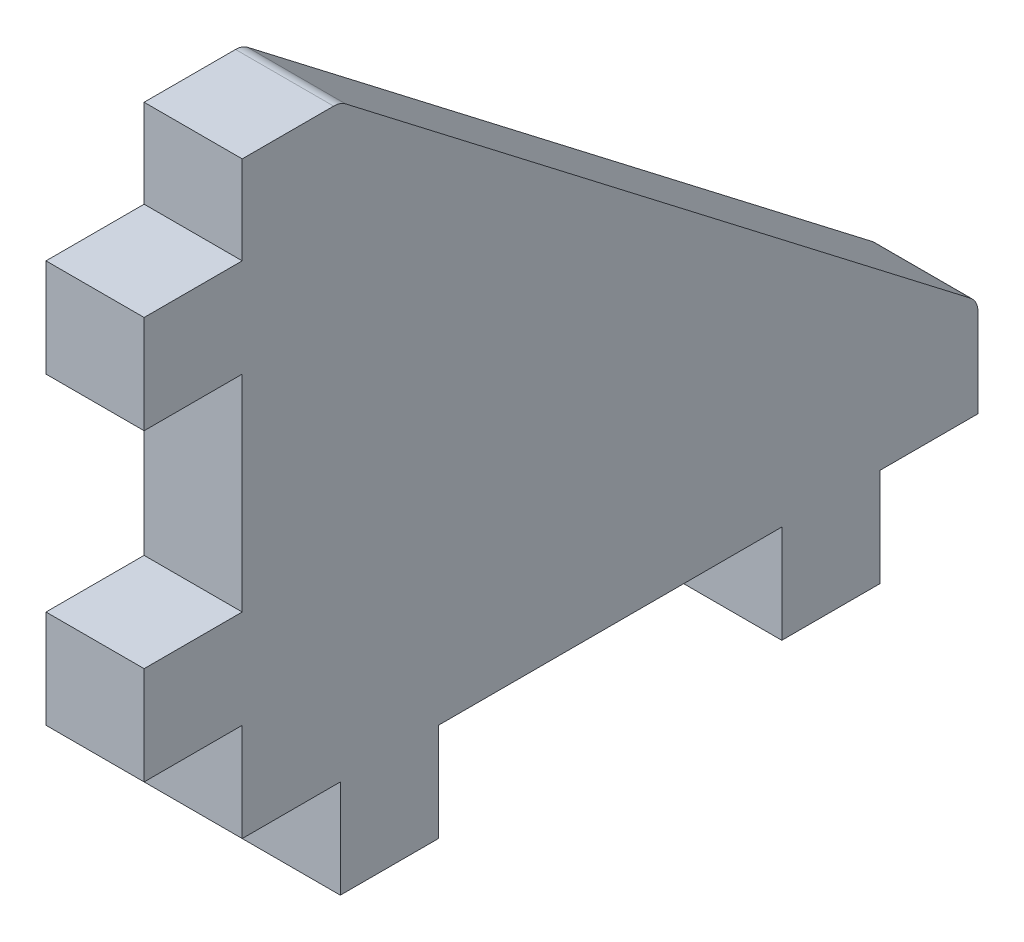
ISO-10303-21;
HEADER;
FILE_DESCRIPTION(('STEP AP214'),'2;1');
FILE_NAME('part.step','',(''),(''),'','','');
FILE_SCHEMA(('AUTOMOTIVE_DESIGN { 1 0 10303 214 1 1 1 1 }'));
ENDSEC;
DATA;
#1=APPLICATION_CONTEXT('core data for automotive mechanical design processes');
#2=APPLICATION_PROTOCOL_DEFINITION('international standard','automotive_design',2000,#1);
#3=PRODUCT_CONTEXT('',#1,'mechanical');
#4=PRODUCT('Part','Part','',(#3));
#5=PRODUCT_RELATED_PRODUCT_CATEGORY('part','',(#4));
#6=PRODUCT_DEFINITION_FORMATION('','',#4);
#7=PRODUCT_DEFINITION_CONTEXT('part definition',#1,'design');
#8=PRODUCT_DEFINITION('design','',#6,#7);
#9=PRODUCT_DEFINITION_SHAPE('','',#8);
#10=(LENGTH_UNIT() NAMED_UNIT(*) SI_UNIT(.MILLI.,.METRE.));
#11=(NAMED_UNIT(*) PLANE_ANGLE_UNIT() SI_UNIT($,.RADIAN.));
#12=(NAMED_UNIT(*) SI_UNIT($,.STERADIAN.) SOLID_ANGLE_UNIT());
#13=UNCERTAINTY_MEASURE_WITH_UNIT(LENGTH_MEASURE(1.E-05),#10,'distance_accuracy_value','');
#14=(GEOMETRIC_REPRESENTATION_CONTEXT(3) GLOBAL_UNCERTAINTY_ASSIGNED_CONTEXT((#13)) GLOBAL_UNIT_ASSIGNED_CONTEXT((#10,
#11,#12)) REPRESENTATION_CONTEXT('',''));
#15=CARTESIAN_POINT('',(0.,0.,0.));
#16=DIRECTION('',(0.,0.,1.));
#17=DIRECTION('',(1.,0.,0.));
#18=AXIS2_PLACEMENT_3D('',#15,#16,#17);
#19=CARTESIAN_POINT('',(20.,0.,0.));
#20=DIRECTION('',(0.,0.,-1.));
#21=DIRECTION('',(-1.,0.,0.));
#22=AXIS2_PLACEMENT_3D('',#19,#20,#21);
#23=PLANE('',#22);
#24=DIRECTION('',(0.,-1.,0.));
#25=VECTOR('',#24,1.);
#26=CARTESIAN_POINT('',(0.,0.,0.));
#27=LINE('',#26,#25);
#28=CARTESIAN_POINT('',(0.,20.,0.));
#29=VERTEX_POINT('',#28);
#30=CARTESIAN_POINT('',(0.,0.,0.));
#31=VERTEX_POINT('',#30);
#32=EDGE_CURVE('E214',#29,#31,#27,.T.);
#33=ORIENTED_EDGE('',*,*,#32,.T.);
#34=DIRECTION('',(-1.,0.,0.));
#35=VECTOR('',#34,1.);
#36=CARTESIAN_POINT('',(20.,0.,0.));
#37=LINE('',#36,#35);
#38=CARTESIAN_POINT('',(20.,0.,0.));
#39=VERTEX_POINT('',#38);
#40=EDGE_CURVE('E196',#39,#31,#37,.T.);
#41=ORIENTED_EDGE('',*,*,#40,.F.);
#42=DIRECTION('',(0.,-1.,0.));
#43=VECTOR('',#42,1.);
#44=CARTESIAN_POINT('',(20.,0.,0.));
#45=LINE('',#44,#43);
#46=CARTESIAN_POINT('',(20.,20.,0.));
#47=VERTEX_POINT('',#46);
#48=EDGE_CURVE('E202',#47,#39,#45,.T.);
#49=ORIENTED_EDGE('',*,*,#48,.F.);
#50=DIRECTION('',(-1.,0.,0.));
#51=VECTOR('',#50,1.);
#52=CARTESIAN_POINT('',(20.,20.,0.));
#53=LINE('',#52,#51);
#54=EDGE_CURVE('E278',#47,#29,#53,.T.);
#55=ORIENTED_EDGE('',*,*,#54,.T.);
#56=EDGE_LOOP('',(#33,#41,#49,#55));
#57=FACE_BOUND('',#56,.T.);
#58=ADVANCED_FACE('F34',(#57),#23,.F.);
#59=CARTESIAN_POINT('',(20.,0.,0.));
#60=DIRECTION('',(0.,1.,0.));
#61=DIRECTION('',(0.,0.,1.));
#62=AXIS2_PLACEMENT_3D('',#59,#60,#61);
#63=PLANE('',#62);
#64=DIRECTION('',(0.,0.,-1.));
#65=VECTOR('',#64,1.);
#66=CARTESIAN_POINT('',(0.,0.,0.));
#67=LINE('',#66,#65);
#68=CARTESIAN_POINT('',(0.,0.,-20.));
#69=VERTEX_POINT('',#68);
#70=EDGE_CURVE('E340',#31,#69,#67,.T.);
#71=ORIENTED_EDGE('',*,*,#70,.T.);
#72=DIRECTION('',(-1.,0.,0.));
#73=VECTOR('',#72,1.);
#74=CARTESIAN_POINT('',(20.,0.,-20.));
#75=LINE('',#74,#73);
#76=CARTESIAN_POINT('',(20.,0.,-20.));
#77=VERTEX_POINT('',#76);
#78=EDGE_CURVE('E199',#77,#69,#75,.T.);
#79=ORIENTED_EDGE('',*,*,#78,.F.);
#80=DIRECTION('',(0.,0.,-1.));
#81=VECTOR('',#80,1.);
#82=CARTESIAN_POINT('',(20.,0.,0.));
#83=LINE('',#82,#81);
#84=EDGE_CURVE('E192',#39,#77,#83,.T.);
#85=ORIENTED_EDGE('',*,*,#84,.F.);
#86=ORIENTED_EDGE('',*,*,#40,.T.);
#87=EDGE_LOOP('',(#71,#79,#85,#86));
#88=FACE_BOUND('',#87,.T.);
#89=ADVANCED_FACE('F194',(#88),#63,.F.);
#90=CARTESIAN_POINT('',(20.,0.,-20.));
#91=DIRECTION('',(0.,0.,-1.));
#92=DIRECTION('',(0.,1.,0.));
#93=AXIS2_PLACEMENT_3D('',#90,#91,#92);
#94=PLANE('',#93);
#95=DIRECTION('',(0.,-1.,0.));
#96=VECTOR('',#95,1.);
#97=CARTESIAN_POINT('',(0.,0.,-20.));
#98=LINE('',#97,#96);
#99=CARTESIAN_POINT('',(0.,-20.,-20.));
#100=VERTEX_POINT('',#99);
#101=EDGE_CURVE('E334',#69,#100,#98,.T.);
#102=ORIENTED_EDGE('',*,*,#101,.T.);
#103=DIRECTION('',(-1.,0.,0.));
#104=VECTOR('',#103,1.);
#105=CARTESIAN_POINT('',(20.,-20.,-20.));
#106=LINE('',#105,#104);
#107=CARTESIAN_POINT('',(20.,-20.,-20.));
#108=VERTEX_POINT('',#107);
#109=EDGE_CURVE('E219',#108,#100,#106,.T.);
#110=ORIENTED_EDGE('',*,*,#109,.F.);
#111=DIRECTION('',(0.,-1.,0.));
#112=VECTOR('',#111,1.);
#113=CARTESIAN_POINT('',(20.,0.,-20.));
#114=LINE('',#113,#112);
#115=EDGE_CURVE('E201',#77,#108,#114,.T.);
#116=ORIENTED_EDGE('',*,*,#115,.F.);
#117=ORIENTED_EDGE('',*,*,#78,.T.);
#118=EDGE_LOOP('',(#102,#110,#116,#117));
#119=FACE_BOUND('',#118,.T.);
#120=ADVANCED_FACE('F382',(#119),#94,.F.);
#121=CARTESIAN_POINT('',(20.,-20.,-20.));
#122=DIRECTION('',(0.,1.,0.));
#123=DIRECTION('',(0.,0.,1.));
#124=AXIS2_PLACEMENT_3D('',#121,#122,#123);
#125=PLANE('',#124);
#126=DIRECTION('',(0.,0.,-1.));
#127=VECTOR('',#126,1.);
#128=CARTESIAN_POINT('',(0.,-20.,-20.));
#129=LINE('',#128,#127);
#130=CARTESIAN_POINT('',(0.,-20.,-40.0000000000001));
#131=VERTEX_POINT('',#130);
#132=EDGE_CURVE('E329',#100,#131,#129,.T.);
#133=ORIENTED_EDGE('',*,*,#132,.T.);
#134=DIRECTION('',(-1.,0.,0.));
#135=VECTOR('',#134,1.);
#136=CARTESIAN_POINT('',(20.,-20.,-40.0000000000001));
#137=LINE('',#136,#135);
#138=CARTESIAN_POINT('',(20.,-20.,-40.0000000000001));
#139=VERTEX_POINT('',#138);
#140=EDGE_CURVE('E320',#139,#131,#137,.T.);
#141=ORIENTED_EDGE('',*,*,#140,.F.);
#142=DIRECTION('',(0.,0.,-1.));
#143=VECTOR('',#142,1.);
#144=CARTESIAN_POINT('',(20.,-20.,-20.));
#145=LINE('',#144,#143);
#146=EDGE_CURVE('E330',#108,#139,#145,.T.);
#147=ORIENTED_EDGE('',*,*,#146,.F.);
#148=ORIENTED_EDGE('',*,*,#109,.T.);
#149=EDGE_LOOP('',(#133,#141,#147,#148));
#150=FACE_BOUND('',#149,.T.);
#151=ADVANCED_FACE('F327',(#150),#125,.F.);
#152=CARTESIAN_POINT('',(20.,-20.,-40.0000000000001));
#153=DIRECTION('',(0.,0.,1.));
#154=DIRECTION('',(0.,-1.,0.));
#155=AXIS2_PLACEMENT_3D('',#152,#153,#154);
#156=PLANE('',#155);
#157=DIRECTION('',(0.,1.,0.));
#158=VECTOR('',#157,1.);
#159=CARTESIAN_POINT('',(0.,-20.,-40.0000000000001));
#160=LINE('',#159,#158);
#161=CARTESIAN_POINT('',(0.,0.,-40.));
#162=VERTEX_POINT('',#161);
#163=EDGE_CURVE('E336',#131,#162,#160,.T.);
#164=ORIENTED_EDGE('',*,*,#163,.T.);
#165=DIRECTION('',(-1.,0.,0.));
#166=VECTOR('',#165,1.);
#167=CARTESIAN_POINT('',(20.,0.,-40.));
#168=LINE('',#167,#166);
#169=CARTESIAN_POINT('',(20.,0.,-40.));
#170=VERTEX_POINT('',#169);
#171=EDGE_CURVE('E317',#170,#162,#168,.T.);
#172=ORIENTED_EDGE('',*,*,#171,.F.);
#173=DIRECTION('',(0.,1.,0.));
#174=VECTOR('',#173,1.);
#175=CARTESIAN_POINT('',(20.,-20.,-40.0000000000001));
#176=LINE('',#175,#174);
#177=EDGE_CURVE('E384',#139,#170,#176,.T.);
#178=ORIENTED_EDGE('',*,*,#177,.F.);
#179=ORIENTED_EDGE('',*,*,#140,.T.);
#180=EDGE_LOOP('',(#164,#172,#178,#179));
#181=FACE_BOUND('',#180,.T.);
#182=ADVANCED_FACE('F406',(#181),#156,.F.);
#183=CARTESIAN_POINT('',(20.,0.,-40.));
#184=DIRECTION('',(0.,1.,0.));
#185=DIRECTION('',(0.,0.,1.));
#186=AXIS2_PLACEMENT_3D('',#183,#184,#185);
#187=PLANE('',#186);
#188=DIRECTION('',(0.,0.,-1.));
#189=VECTOR('',#188,1.);
#190=CARTESIAN_POINT('',(0.,0.,-40.));
#191=LINE('',#190,#189);
#192=CARTESIAN_POINT('',(0.,0.,-110.));
#193=VERTEX_POINT('',#192);
#194=EDGE_CURVE('E338',#162,#193,#191,.T.);
#195=ORIENTED_EDGE('',*,*,#194,.T.);
#196=DIRECTION('',(-1.,0.,0.));
#197=VECTOR('',#196,1.);
#198=CARTESIAN_POINT('',(20.,0.,-110.));
#199=LINE('',#198,#197);
#200=CARTESIAN_POINT('',(20.,0.,-110.));
#201=VERTEX_POINT('',#200);
#202=EDGE_CURVE('E314',#201,#193,#199,.T.);
#203=ORIENTED_EDGE('',*,*,#202,.F.);
#204=DIRECTION('',(0.,0.,-1.));
#205=VECTOR('',#204,1.);
#206=CARTESIAN_POINT('',(20.,0.,-40.));
#207=LINE('',#206,#205);
#208=EDGE_CURVE('E388',#170,#201,#207,.T.);
#209=ORIENTED_EDGE('',*,*,#208,.F.);
#210=ORIENTED_EDGE('',*,*,#171,.T.);
#211=EDGE_LOOP('',(#195,#203,#209,#210));
#212=FACE_BOUND('',#211,.T.);
#213=ADVANCED_FACE('F402',(#212),#187,.F.);
#214=CARTESIAN_POINT('',(20.,-20.,-110.));
#215=DIRECTION('',(0.,0.,-1.));
#216=DIRECTION('',(-1.,0.,0.));
#217=AXIS2_PLACEMENT_3D('',#214,#215,#216);
#218=PLANE('',#217);
#219=DIRECTION('',(0.,-1.,0.));
#220=VECTOR('',#219,1.);
#221=CARTESIAN_POINT('',(0.,-20.,-110.));
#222=LINE('',#221,#220);
#223=CARTESIAN_POINT('',(0.,-20.,-110.));
#224=VERTEX_POINT('',#223);
#225=EDGE_CURVE('E345',#193,#224,#222,.T.);
#226=ORIENTED_EDGE('',*,*,#225,.T.);
#227=DIRECTION('',(-1.,0.,0.));
#228=VECTOR('',#227,1.);
#229=CARTESIAN_POINT('',(20.,-20.,-110.));
#230=LINE('',#229,#228);
#231=CARTESIAN_POINT('',(20.,-20.,-110.));
#232=VERTEX_POINT('',#231);
#233=EDGE_CURVE('E311',#232,#224,#230,.T.);
#234=ORIENTED_EDGE('',*,*,#233,.F.);
#235=DIRECTION('',(0.,-1.,0.));
#236=VECTOR('',#235,1.);
#237=CARTESIAN_POINT('',(20.,-20.,-110.));
#238=LINE('',#237,#236);
#239=EDGE_CURVE('E390',#201,#232,#238,.T.);
#240=ORIENTED_EDGE('',*,*,#239,.F.);
#241=ORIENTED_EDGE('',*,*,#202,.T.);
#242=EDGE_LOOP('',(#226,#234,#240,#241));
#243=FACE_BOUND('',#242,.T.);
#244=ADVANCED_FACE('F398',(#243),#218,.F.);
#245=CARTESIAN_POINT('',(20.,-20.,-130.));
#246=DIRECTION('',(0.,1.,0.));
#247=DIRECTION('',(0.,0.,1.));
#248=AXIS2_PLACEMENT_3D('',#245,#246,#247);
#249=PLANE('',#248);
#250=DIRECTION('',(0.,0.,-1.));
#251=VECTOR('',#250,1.);
#252=CARTESIAN_POINT('',(0.,-20.,-130.));
#253=LINE('',#252,#251);
#254=CARTESIAN_POINT('',(0.,-20.,-130.));
#255=VERTEX_POINT('',#254);
#256=EDGE_CURVE('E347',#224,#255,#253,.T.);
#257=ORIENTED_EDGE('',*,*,#256,.T.);
#258=DIRECTION('',(-1.,0.,0.));
#259=VECTOR('',#258,1.);
#260=CARTESIAN_POINT('',(20.,-20.,-130.));
#261=LINE('',#260,#259);
#262=CARTESIAN_POINT('',(20.,-20.,-130.));
#263=VERTEX_POINT('',#262);
#264=EDGE_CURVE('E308',#263,#255,#261,.T.);
#265=ORIENTED_EDGE('',*,*,#264,.F.);
#266=DIRECTION('',(0.,0.,-1.));
#267=VECTOR('',#266,1.);
#268=CARTESIAN_POINT('',(20.,-20.,-130.));
#269=LINE('',#268,#267);
#270=EDGE_CURVE('E362',#232,#263,#269,.T.);
#271=ORIENTED_EDGE('',*,*,#270,.F.);
#272=ORIENTED_EDGE('',*,*,#233,.T.);
#273=EDGE_LOOP('',(#257,#265,#271,#272));
#274=FACE_BOUND('',#273,.T.);
#275=ADVANCED_FACE('F395',(#274),#249,.F.);
#276=CARTESIAN_POINT('',(20.,0.,-130.));
#277=DIRECTION('',(0.,0.,1.));
#278=DIRECTION('',(1.,0.,0.));
#279=AXIS2_PLACEMENT_3D('',#276,#277,#278);
#280=PLANE('',#279);
#281=DIRECTION('',(0.,1.,0.));
#282=VECTOR('',#281,1.);
#283=CARTESIAN_POINT('',(0.,0.,-130.));
#284=LINE('',#283,#282);
#285=CARTESIAN_POINT('',(0.,0.,-130.));
#286=VERTEX_POINT('',#285);
#287=EDGE_CURVE('E258',#255,#286,#284,.T.);
#288=ORIENTED_EDGE('',*,*,#287,.T.);
#289=DIRECTION('',(-1.,0.,0.));
#290=VECTOR('',#289,1.);
#291=CARTESIAN_POINT('',(20.,0.,-130.));
#292=LINE('',#291,#290);
#293=CARTESIAN_POINT('',(20.,0.,-130.));
#294=VERTEX_POINT('',#293);
#295=EDGE_CURVE('E305',#294,#286,#292,.T.);
#296=ORIENTED_EDGE('',*,*,#295,.F.);
#297=DIRECTION('',(0.,1.,0.));
#298=VECTOR('',#297,1.);
#299=CARTESIAN_POINT('',(20.,0.,-130.));
#300=LINE('',#299,#298);
#301=EDGE_CURVE('E359',#263,#294,#300,.T.);
#302=ORIENTED_EDGE('',*,*,#301,.F.);
#303=ORIENTED_EDGE('',*,*,#264,.T.);
#304=EDGE_LOOP('',(#288,#296,#302,#303));
#305=FACE_BOUND('',#304,.T.);
#306=ADVANCED_FACE('F351',(#305),#280,.F.);
#307=CARTESIAN_POINT('',(20.,0.,-130.));
#308=DIRECTION('',(0.,1.,0.));
#309=DIRECTION('',(0.,0.,1.));
#310=AXIS2_PLACEMENT_3D('',#307,#308,#309);
#311=PLANE('',#310);
#312=DIRECTION('',(0.,0.,-1.));
#313=VECTOR('',#312,1.);
#314=CARTESIAN_POINT('',(0.,0.,-130.));
#315=LINE('',#314,#313);
#316=CARTESIAN_POINT('',(0.,0.,-150.));
#317=VERTEX_POINT('',#316);
#318=EDGE_CURVE('E254',#286,#317,#315,.T.);
#319=ORIENTED_EDGE('',*,*,#318,.T.);
#320=DIRECTION('',(-1.,0.,0.));
#321=VECTOR('',#320,1.);
#322=CARTESIAN_POINT('',(20.,0.,-150.));
#323=LINE('',#322,#321);
#324=CARTESIAN_POINT('',(20.,0.,-150.));
#325=VERTEX_POINT('',#324);
#326=EDGE_CURVE('E253',#325,#317,#323,.T.);
#327=ORIENTED_EDGE('',*,*,#326,.F.);
#328=DIRECTION('',(0.,0.,-1.));
#329=VECTOR('',#328,1.);
#330=CARTESIAN_POINT('',(20.,0.,-130.));
#331=LINE('',#330,#329);
#332=EDGE_CURVE('E358',#294,#325,#331,.T.);
#333=ORIENTED_EDGE('',*,*,#332,.F.);
#334=ORIENTED_EDGE('',*,*,#295,.T.);
#335=EDGE_LOOP('',(#319,#327,#333,#334));
#336=FACE_BOUND('',#335,.T.);
#337=ADVANCED_FACE('F357',(#336),#311,.F.);
#338=CARTESIAN_POINT('',(20.,0.,-150.));
#339=DIRECTION('',(0.,0.,1.));
#340=DIRECTION('',(1.,0.,0.));
#341=AXIS2_PLACEMENT_3D('',#338,#339,#340);
#342=PLANE('',#341);
#343=DIRECTION('',(0.,1.,0.));
#344=VECTOR('',#343,1.);
#345=CARTESIAN_POINT('',(0.,0.,-150.));
#346=LINE('',#345,#344);
#347=CARTESIAN_POINT('',(0.,18.0303940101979,-150.));
#348=VERTEX_POINT('',#347);
#349=EDGE_CURVE('E248',#317,#348,#346,.T.);
#350=ORIENTED_EDGE('',*,*,#349,.T.);
#351=DIRECTION('',(-1.,0.,0.));
#352=VECTOR('',#351,1.);
#353=CARTESIAN_POINT('',(20.,18.0303940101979,-150.));
#354=LINE('',#353,#352);
#355=CARTESIAN_POINT('',(20.,18.0303940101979,-150.));
#356=VERTEX_POINT('',#355);
#357=EDGE_CURVE('E57',#348,#356,#354,.F.);
#358=ORIENTED_EDGE('',*,*,#357,.T.);
#359=DIRECTION('',(0.,1.,0.));
#360=VECTOR('',#359,1.);
#361=CARTESIAN_POINT('',(20.,0.,-150.));
#362=LINE('',#361,#360);
#363=EDGE_CURVE('E233',#325,#356,#362,.T.);
#364=ORIENTED_EDGE('',*,*,#363,.F.);
#365=ORIENTED_EDGE('',*,*,#326,.T.);
#366=EDGE_LOOP('',(#350,#358,#364,#365));
#367=FACE_BOUND('',#366,.T.);
#368=ADVANCED_FACE('F251',(#367),#342,.F.);
#369=CARTESIAN_POINT('',(20.,120.,-20.));
#370=DIRECTION('',(0.,-0.7926239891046,0.609710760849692));
#371=DIRECTION('',(0.,-0.609710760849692,-0.7926239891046));
#372=AXIS2_PLACEMENT_3D('',#369,#370,#371);
#373=PLANE('',#372);
#374=DIRECTION('',(0.,0.609710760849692,0.7926239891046));
#375=VECTOR('',#374,1.);
#376=CARTESIAN_POINT('',(20.,120.,-20.));
#377=LINE('',#376,#375);
#378=CARTESIAN_POINT('',(20.,21.2008899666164,-148.438843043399));
#379=VERTEX_POINT('',#378);
#380=CARTESIAN_POINT('',(20.,119.170495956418,-21.0783552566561));
#381=VERTEX_POINT('',#380);
#382=EDGE_CURVE('E232',#379,#381,#377,.T.);
#383=ORIENTED_EDGE('',*,*,#382,.F.);
#384=DIRECTION('',(-1.,0.,0.));
#385=VECTOR('',#384,1.);
#386=CARTESIAN_POINT('',(20.,21.2008899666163,-148.438843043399));
#387=LINE('',#386,#385);
#388=CARTESIAN_POINT('',(0.,21.2008899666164,-148.438843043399));
#389=VERTEX_POINT('',#388);
#390=EDGE_CURVE('E217',#379,#389,#387,.T.);
#391=ORIENTED_EDGE('',*,*,#390,.T.);
#392=DIRECTION('',(0.,0.609710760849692,0.7926239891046));
#393=VECTOR('',#392,1.);
#394=CARTESIAN_POINT('',(0.,120.,-20.));
#395=LINE('',#394,#393);
#396=CARTESIAN_POINT('',(0.,119.170495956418,-21.0783552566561));
#397=VERTEX_POINT('',#396);
#398=EDGE_CURVE('E249',#389,#397,#395,.T.);
#399=ORIENTED_EDGE('',*,*,#398,.T.);
#400=DIRECTION('',(-1.,0.,0.));
#401=VECTOR('',#400,1.);
#402=CARTESIAN_POINT('',(20.,119.170495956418,-21.0783552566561));
#403=LINE('',#402,#401);
#404=EDGE_CURVE('E215',#397,#381,#403,.F.);
#405=ORIENTED_EDGE('',*,*,#404,.T.);
#406=EDGE_LOOP('',(#383,#391,#399,#405));
#407=FACE_BOUND('',#406,.T.);
#408=ADVANCED_FACE('F237',(#407),#373,.F.);
#409=CARTESIAN_POINT('',(20.,120.,0.));
#410=DIRECTION('',(0.,-1.,0.));
#411=DIRECTION('',(0.,0.,-1.));
#412=AXIS2_PLACEMENT_3D('',#409,#410,#411);
#413=PLANE('',#412);
#414=DIRECTION('',(0.,0.,1.));
#415=VECTOR('',#414,1.);
#416=CARTESIAN_POINT('',(20.,120.,0.));
#417=LINE('',#416,#415);
#418=CARTESIAN_POINT('',(20.,120.,-18.6395122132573));
#419=VERTEX_POINT('',#418);
#420=CARTESIAN_POINT('',(20.,120.,0.));
#421=VERTEX_POINT('',#420);
#422=EDGE_CURVE('E241',#419,#421,#417,.T.);
#423=ORIENTED_EDGE('',*,*,#422,.F.);
#424=DIRECTION('',(-1.,0.,0.));
#425=VECTOR('',#424,1.);
#426=CARTESIAN_POINT('',(20.,120.,-18.6395122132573));
#427=LINE('',#426,#425);
#428=CARTESIAN_POINT('',(0.,120.,-18.6395122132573));
#429=VERTEX_POINT('',#428);
#430=EDGE_CURVE('E11',#419,#429,#427,.T.);
#431=ORIENTED_EDGE('',*,*,#430,.T.);
#432=DIRECTION('',(0.,0.,1.));
#433=VECTOR('',#432,1.);
#434=CARTESIAN_POINT('',(0.,120.,0.));
#435=LINE('',#434,#433);
#436=CARTESIAN_POINT('',(0.,120.,0.));
#437=VERTEX_POINT('',#436);
#438=EDGE_CURVE('E256',#429,#437,#435,.T.);
#439=ORIENTED_EDGE('',*,*,#438,.T.);
#440=DIRECTION('',(-1.,0.,0.));
#441=VECTOR('',#440,1.);
#442=CARTESIAN_POINT('',(20.,120.,0.));
#443=LINE('',#442,#441);
#444=EDGE_CURVE('E301',#421,#437,#443,.T.);
#445=ORIENTED_EDGE('',*,*,#444,.F.);
#446=EDGE_LOOP('',(#423,#431,#439,#445));
#447=FACE_BOUND('',#446,.T.);
#448=ADVANCED_FACE('F465',(#447),#413,.F.);
#449=CARTESIAN_POINT('',(20.,102.,0.));
#450=DIRECTION('',(0.,0.,-1.));
#451=DIRECTION('',(-1.,0.,0.));
#452=AXIS2_PLACEMENT_3D('',#449,#450,#451);
#453=PLANE('',#452);
#454=DIRECTION('',(0.,-1.,0.));
#455=VECTOR('',#454,1.);
#456=CARTESIAN_POINT('',(0.,102.,0.));
#457=LINE('',#456,#455);
#458=CARTESIAN_POINT('',(0.,102.,0.));
#459=VERTEX_POINT('',#458);
#460=EDGE_CURVE('E263',#437,#459,#457,.T.);
#461=ORIENTED_EDGE('',*,*,#460,.T.);
#462=DIRECTION('',(-1.,0.,0.));
#463=VECTOR('',#462,1.);
#464=CARTESIAN_POINT('',(20.,102.,0.));
#465=LINE('',#464,#463);
#466=CARTESIAN_POINT('',(20.,102.,0.));
#467=VERTEX_POINT('',#466);
#468=EDGE_CURVE('E298',#467,#459,#465,.T.);
#469=ORIENTED_EDGE('',*,*,#468,.F.);
#470=DIRECTION('',(0.,-1.,0.));
#471=VECTOR('',#470,1.);
#472=CARTESIAN_POINT('',(20.,102.,0.));
#473=LINE('',#472,#471);
#474=EDGE_CURVE('E367',#421,#467,#473,.T.);
#475=ORIENTED_EDGE('',*,*,#474,.F.);
#476=ORIENTED_EDGE('',*,*,#444,.T.);
#477=EDGE_LOOP('',(#461,#469,#475,#476));
#478=FACE_BOUND('',#477,.T.);
#479=ADVANCED_FACE('F461',(#478),#453,.F.);
#480=CARTESIAN_POINT('',(20.,102.,0.));
#481=DIRECTION('',(0.,-1.,0.));
#482=DIRECTION('',(0.,0.,-1.));
#483=AXIS2_PLACEMENT_3D('',#480,#481,#482);
#484=PLANE('',#483);
#485=DIRECTION('',(0.,0.,1.));
#486=VECTOR('',#485,1.);
#487=CARTESIAN_POINT('',(0.,102.,0.));
#488=LINE('',#487,#486);
#489=CARTESIAN_POINT('',(0.,102.,20.));
#490=VERTEX_POINT('',#489);
#491=EDGE_CURVE('E265',#459,#490,#488,.T.);
#492=ORIENTED_EDGE('',*,*,#491,.T.);
#493=DIRECTION('',(-1.,0.,0.));
#494=VECTOR('',#493,1.);
#495=CARTESIAN_POINT('',(20.,102.,20.));
#496=LINE('',#495,#494);
#497=CARTESIAN_POINT('',(20.,102.,20.));
#498=VERTEX_POINT('',#497);
#499=EDGE_CURVE('E295',#498,#490,#496,.T.);
#500=ORIENTED_EDGE('',*,*,#499,.F.);
#501=DIRECTION('',(0.,0.,1.));
#502=VECTOR('',#501,1.);
#503=CARTESIAN_POINT('',(20.,102.,0.));
#504=LINE('',#503,#502);
#505=EDGE_CURVE('E369',#467,#498,#504,.T.);
#506=ORIENTED_EDGE('',*,*,#505,.F.);
#507=ORIENTED_EDGE('',*,*,#468,.T.);
#508=EDGE_LOOP('',(#492,#500,#506,#507));
#509=FACE_BOUND('',#508,.T.);
#510=ADVANCED_FACE('F457',(#509),#484,.F.);
#511=CARTESIAN_POINT('',(20.,102.,20.));
#512=DIRECTION('',(0.,0.,-1.));
#513=DIRECTION('',(-1.,0.,0.));
#514=AXIS2_PLACEMENT_3D('',#511,#512,#513);
#515=PLANE('',#514);
#516=DIRECTION('',(0.,-1.,0.));
#517=VECTOR('',#516,1.);
#518=CARTESIAN_POINT('',(0.,102.,20.));
#519=LINE('',#518,#517);
#520=CARTESIAN_POINT('',(0.,82.,20.));
#521=VERTEX_POINT('',#520);
#522=EDGE_CURVE('E267',#490,#521,#519,.T.);
#523=ORIENTED_EDGE('',*,*,#522,.T.);
#524=DIRECTION('',(-1.,0.,0.));
#525=VECTOR('',#524,1.);
#526=CARTESIAN_POINT('',(20.,82.,20.));
#527=LINE('',#526,#525);
#528=CARTESIAN_POINT('',(20.,82.,20.));
#529=VERTEX_POINT('',#528);
#530=EDGE_CURVE('E292',#529,#521,#527,.T.);
#531=ORIENTED_EDGE('',*,*,#530,.F.);
#532=DIRECTION('',(0.,-1.,0.));
#533=VECTOR('',#532,1.);
#534=CARTESIAN_POINT('',(20.,102.,20.));
#535=LINE('',#534,#533);
#536=EDGE_CURVE('E371',#498,#529,#535,.T.);
#537=ORIENTED_EDGE('',*,*,#536,.F.);
#538=ORIENTED_EDGE('',*,*,#499,.T.);
#539=EDGE_LOOP('',(#523,#531,#537,#538));
#540=FACE_BOUND('',#539,.T.);
#541=ADVANCED_FACE('F453',(#540),#515,.F.);
#542=CARTESIAN_POINT('',(20.,82.,20.));
#543=DIRECTION('',(0.,1.,0.));
#544=DIRECTION('',(0.,0.,1.));
#545=AXIS2_PLACEMENT_3D('',#542,#543,#544);
#546=PLANE('',#545);
#547=DIRECTION('',(0.,0.,-1.));
#548=VECTOR('',#547,1.);
#549=CARTESIAN_POINT('',(0.,82.,20.));
#550=LINE('',#549,#548);
#551=CARTESIAN_POINT('',(0.,82.,0.));
#552=VERTEX_POINT('',#551);
#553=EDGE_CURVE('E269',#521,#552,#550,.T.);
#554=ORIENTED_EDGE('',*,*,#553,.T.);
#555=DIRECTION('',(-1.,0.,0.));
#556=VECTOR('',#555,1.);
#557=CARTESIAN_POINT('',(20.,82.,0.));
#558=LINE('',#557,#556);
#559=CARTESIAN_POINT('',(20.,82.,0.));
#560=VERTEX_POINT('',#559);
#561=EDGE_CURVE('E289',#560,#552,#558,.T.);
#562=ORIENTED_EDGE('',*,*,#561,.F.);
#563=DIRECTION('',(0.,0.,-1.));
#564=VECTOR('',#563,1.);
#565=CARTESIAN_POINT('',(20.,82.,20.));
#566=LINE('',#565,#564);
#567=EDGE_CURVE('E373',#529,#560,#566,.T.);
#568=ORIENTED_EDGE('',*,*,#567,.F.);
#569=ORIENTED_EDGE('',*,*,#530,.T.);
#570=EDGE_LOOP('',(#554,#562,#568,#569));
#571=FACE_BOUND('',#570,.T.);
#572=ADVANCED_FACE('F449',(#571),#546,.F.);
#573=CARTESIAN_POINT('',(20.,40.,0.));
#574=DIRECTION('',(0.,0.,-1.));
#575=DIRECTION('',(-1.,0.,0.));
#576=AXIS2_PLACEMENT_3D('',#573,#574,#575);
#577=PLANE('',#576);
#578=DIRECTION('',(0.,-1.,0.));
#579=VECTOR('',#578,1.);
#580=CARTESIAN_POINT('',(0.,40.,0.));
#581=LINE('',#580,#579);
#582=CARTESIAN_POINT('',(0.,40.,0.));
#583=VERTEX_POINT('',#582);
#584=EDGE_CURVE('E271',#552,#583,#581,.T.);
#585=ORIENTED_EDGE('',*,*,#584,.T.);
#586=DIRECTION('',(-1.,0.,0.));
#587=VECTOR('',#586,1.);
#588=CARTESIAN_POINT('',(20.,40.,0.));
#589=LINE('',#588,#587);
#590=CARTESIAN_POINT('',(20.,40.,0.));
#591=VERTEX_POINT('',#590);
#592=EDGE_CURVE('E286',#591,#583,#589,.T.);
#593=ORIENTED_EDGE('',*,*,#592,.F.);
#594=DIRECTION('',(0.,-1.,0.));
#595=VECTOR('',#594,1.);
#596=CARTESIAN_POINT('',(20.,40.,0.));
#597=LINE('',#596,#595);
#598=EDGE_CURVE('E375',#560,#591,#597,.T.);
#599=ORIENTED_EDGE('',*,*,#598,.F.);
#600=ORIENTED_EDGE('',*,*,#561,.T.);
#601=EDGE_LOOP('',(#585,#593,#599,#600));
#602=FACE_BOUND('',#601,.T.);
#603=ADVANCED_FACE('F445',(#602),#577,.F.);
#604=CARTESIAN_POINT('',(20.,40.,20.));
#605=DIRECTION('',(0.,-1.,0.));
#606=DIRECTION('',(0.,0.,-1.));
#607=AXIS2_PLACEMENT_3D('',#604,#605,#606);
#608=PLANE('',#607);
#609=DIRECTION('',(0.,0.,1.));
#610=VECTOR('',#609,1.);
#611=CARTESIAN_POINT('',(0.,40.,20.));
#612=LINE('',#611,#610);
#613=CARTESIAN_POINT('',(0.,40.,20.));
#614=VERTEX_POINT('',#613);
#615=EDGE_CURVE('E273',#583,#614,#612,.T.);
#616=ORIENTED_EDGE('',*,*,#615,.T.);
#617=DIRECTION('',(-1.,0.,0.));
#618=VECTOR('',#617,1.);
#619=CARTESIAN_POINT('',(20.,40.,20.));
#620=LINE('',#619,#618);
#621=CARTESIAN_POINT('',(20.,40.,20.));
#622=VERTEX_POINT('',#621);
#623=EDGE_CURVE('E283',#622,#614,#620,.T.);
#624=ORIENTED_EDGE('',*,*,#623,.F.);
#625=DIRECTION('',(0.,0.,1.));
#626=VECTOR('',#625,1.);
#627=CARTESIAN_POINT('',(20.,40.,20.));
#628=LINE('',#627,#626);
#629=EDGE_CURVE('E377',#591,#622,#628,.T.);
#630=ORIENTED_EDGE('',*,*,#629,.F.);
#631=ORIENTED_EDGE('',*,*,#592,.T.);
#632=EDGE_LOOP('',(#616,#624,#630,#631));
#633=FACE_BOUND('',#632,.T.);
#634=ADVANCED_FACE('F441',(#633),#608,.F.);
#635=CARTESIAN_POINT('',(20.,20.,20.));
#636=DIRECTION('',(0.,0.,-1.));
#637=DIRECTION('',(-1.,0.,0.));
#638=AXIS2_PLACEMENT_3D('',#635,#636,#637);
#639=PLANE('',#638);
#640=DIRECTION('',(0.,-1.,0.));
#641=VECTOR('',#640,1.);
#642=CARTESIAN_POINT('',(0.,20.,20.));
#643=LINE('',#642,#641);
#644=CARTESIAN_POINT('',(0.,20.,20.));
#645=VERTEX_POINT('',#644);
#646=EDGE_CURVE('E275',#614,#645,#643,.T.);
#647=ORIENTED_EDGE('',*,*,#646,.T.);
#648=DIRECTION('',(-1.,0.,0.));
#649=VECTOR('',#648,1.);
#650=CARTESIAN_POINT('',(20.,20.,20.));
#651=LINE('',#650,#649);
#652=CARTESIAN_POINT('',(20.,20.,20.));
#653=VERTEX_POINT('',#652);
#654=EDGE_CURVE('E280',#653,#645,#651,.T.);
#655=ORIENTED_EDGE('',*,*,#654,.F.);
#656=DIRECTION('',(0.,-1.,0.));
#657=VECTOR('',#656,1.);
#658=CARTESIAN_POINT('',(20.,20.,20.));
#659=LINE('',#658,#657);
#660=EDGE_CURVE('E379',#622,#653,#659,.T.);
#661=ORIENTED_EDGE('',*,*,#660,.F.);
#662=ORIENTED_EDGE('',*,*,#623,.T.);
#663=EDGE_LOOP('',(#647,#655,#661,#662));
#664=FACE_BOUND('',#663,.T.);
#665=ADVANCED_FACE('F437',(#664),#639,.F.);
#666=CARTESIAN_POINT('',(20.,20.,0.));
#667=DIRECTION('',(0.,1.,0.));
#668=DIRECTION('',(0.,0.,1.));
#669=AXIS2_PLACEMENT_3D('',#666,#667,#668);
#670=PLANE('',#669);
#671=DIRECTION('',(0.,0.,-1.));
#672=VECTOR('',#671,1.);
#673=CARTESIAN_POINT('',(0.,20.,0.));
#674=LINE('',#673,#672);
#675=EDGE_CURVE('E211',#645,#29,#674,.T.);
#676=ORIENTED_EDGE('',*,*,#675,.T.);
#677=ORIENTED_EDGE('',*,*,#54,.F.);
#678=DIRECTION('',(0.,0.,-1.));
#679=VECTOR('',#678,1.);
#680=CARTESIAN_POINT('',(20.,20.,0.));
#681=LINE('',#680,#679);
#682=EDGE_CURVE('E207',#653,#47,#681,.T.);
#683=ORIENTED_EDGE('',*,*,#682,.F.);
#684=ORIENTED_EDGE('',*,*,#654,.T.);
#685=EDGE_LOOP('',(#676,#677,#683,#684));
#686=FACE_BOUND('',#685,.T.);
#687=ADVANCED_FACE('F432',(#686),#670,.F.);
#688=CARTESIAN_POINT('',(20.,0.,0.));
#689=DIRECTION('',(1.,0.,0.));
#690=DIRECTION('',(0.,0.,-1.));
#691=AXIS2_PLACEMENT_3D('',#688,#689,#690);
#692=PLANE('',#691);
#693=ORIENTED_EDGE('',*,*,#363,.T.);
#694=CARTESIAN_POINT('',(20.,18.0303940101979,-146.));
#695=DIRECTION('',(1.,0.,0.));
#696=DIRECTION('',(0.,0.,-1.));
#697=AXIS2_PLACEMENT_3D('',#694,#695,#696);
#698=CIRCLE('',#697,4.);
#699=EDGE_CURVE('E42',#356,#379,#698,.T.);
#700=ORIENTED_EDGE('',*,*,#699,.T.);
#701=ORIENTED_EDGE('',*,*,#382,.T.);
#702=CARTESIAN_POINT('',(20.,116.,-18.6395122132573));
#703=DIRECTION('',(1.,0.,0.));
#704=DIRECTION('',(0.,0.,-1.));
#705=AXIS2_PLACEMENT_3D('',#702,#703,#704);
#706=CIRCLE('',#705,4.);
#707=EDGE_CURVE('E49',#381,#419,#706,.T.);
#708=ORIENTED_EDGE('',*,*,#707,.T.);
#709=ORIENTED_EDGE('',*,*,#422,.T.);
#710=ORIENTED_EDGE('',*,*,#474,.T.);
#711=ORIENTED_EDGE('',*,*,#505,.T.);
#712=ORIENTED_EDGE('',*,*,#536,.T.);
#713=ORIENTED_EDGE('',*,*,#567,.T.);
#714=ORIENTED_EDGE('',*,*,#598,.T.);
#715=ORIENTED_EDGE('',*,*,#629,.T.);
#716=ORIENTED_EDGE('',*,*,#660,.T.);
#717=ORIENTED_EDGE('',*,*,#682,.T.);
#718=ORIENTED_EDGE('',*,*,#48,.T.);
#719=ORIENTED_EDGE('',*,*,#84,.T.);
#720=ORIENTED_EDGE('',*,*,#115,.T.);
#721=ORIENTED_EDGE('',*,*,#146,.T.);
#722=ORIENTED_EDGE('',*,*,#177,.T.);
#723=ORIENTED_EDGE('',*,*,#208,.T.);
#724=ORIENTED_EDGE('',*,*,#239,.T.);
#725=ORIENTED_EDGE('',*,*,#270,.T.);
#726=ORIENTED_EDGE('',*,*,#301,.T.);
#727=ORIENTED_EDGE('',*,*,#332,.T.);
#728=EDGE_LOOP('',(#693,#700,#701,#708,#709,#710,#711,#712,#713,#714,#715,#716,#717,#718,#719,
#720,#721,#722,#723,#724,#725,#726,#727));
#729=FACE_BOUND('',#728,.T.);
#730=ADVANCED_FACE('F205',(#729),#692,.T.);
#731=CARTESIAN_POINT('',(0.,0.,0.));
#732=DIRECTION('',(1.,0.,0.));
#733=DIRECTION('',(0.,0.,-1.));
#734=AXIS2_PLACEMENT_3D('',#731,#732,#733);
#735=PLANE('',#734);
#736=ORIENTED_EDGE('',*,*,#398,.F.);
#737=CARTESIAN_POINT('',(0.,18.0303940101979,-146.));
#738=DIRECTION('',(1.,0.,0.));
#739=DIRECTION('',(0.,0.,-1.));
#740=AXIS2_PLACEMENT_3D('',#737,#738,#739);
#741=CIRCLE('',#740,4.);
#742=EDGE_CURVE('E227',#389,#348,#741,.F.);
#743=ORIENTED_EDGE('',*,*,#742,.T.);
#744=ORIENTED_EDGE('',*,*,#349,.F.);
#745=ORIENTED_EDGE('',*,*,#318,.F.);
#746=ORIENTED_EDGE('',*,*,#287,.F.);
#747=ORIENTED_EDGE('',*,*,#256,.F.);
#748=ORIENTED_EDGE('',*,*,#225,.F.);
#749=ORIENTED_EDGE('',*,*,#194,.F.);
#750=ORIENTED_EDGE('',*,*,#163,.F.);
#751=ORIENTED_EDGE('',*,*,#132,.F.);
#752=ORIENTED_EDGE('',*,*,#101,.F.);
#753=ORIENTED_EDGE('',*,*,#70,.F.);
#754=ORIENTED_EDGE('',*,*,#32,.F.);
#755=ORIENTED_EDGE('',*,*,#675,.F.);
#756=ORIENTED_EDGE('',*,*,#646,.F.);
#757=ORIENTED_EDGE('',*,*,#615,.F.);
#758=ORIENTED_EDGE('',*,*,#584,.F.);
#759=ORIENTED_EDGE('',*,*,#553,.F.);
#760=ORIENTED_EDGE('',*,*,#522,.F.);
#761=ORIENTED_EDGE('',*,*,#491,.F.);
#762=ORIENTED_EDGE('',*,*,#460,.F.);
#763=ORIENTED_EDGE('',*,*,#438,.F.);
#764=CARTESIAN_POINT('',(0.,116.,-18.6395122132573));
#765=DIRECTION('',(1.,0.,0.));
#766=DIRECTION('',(0.,0.,-1.));
#767=AXIS2_PLACEMENT_3D('',#764,#765,#766);
#768=CIRCLE('',#767,4.);
#769=EDGE_CURVE('E225',#429,#397,#768,.F.);
#770=ORIENTED_EDGE('',*,*,#769,.T.);
#771=EDGE_LOOP('',(#736,#743,#744,#745,#746,#747,#748,#749,#750,#751,#752,#753,#754,#755,#756,
#757,#758,#759,#760,#761,#762,#763,#770));
#772=FACE_BOUND('',#771,.T.);
#773=ADVANCED_FACE('F246',(#772),#735,.F.);
#774=CARTESIAN_POINT('',(20.,18.0303940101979,-146.));
#775=DIRECTION('',(-1.,0.,0.));
#776=DIRECTION('',(0.,0.,1.));
#777=AXIS2_PLACEMENT_3D('',#774,#775,#776);
#778=CYLINDRICAL_SURFACE('',#777,4.);
#779=ORIENTED_EDGE('',*,*,#699,.F.);
#780=ORIENTED_EDGE('',*,*,#357,.F.);
#781=ORIENTED_EDGE('',*,*,#742,.F.);
#782=ORIENTED_EDGE('',*,*,#390,.F.);
#783=EDGE_LOOP('',(#779,#780,#781,#782));
#784=FACE_BOUND('',#783,.T.);
#785=ADVANCED_FACE('F243',(#784),#778,.T.);
#786=CARTESIAN_POINT('',(20.,116.,-18.6395122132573));
#787=DIRECTION('',(-1.,0.,0.));
#788=DIRECTION('',(0.,0.,1.));
#789=AXIS2_PLACEMENT_3D('',#786,#787,#788);
#790=CYLINDRICAL_SURFACE('',#789,4.);
#791=ORIENTED_EDGE('',*,*,#707,.F.);
#792=ORIENTED_EDGE('',*,*,#404,.F.);
#793=ORIENTED_EDGE('',*,*,#769,.F.);
#794=ORIENTED_EDGE('',*,*,#430,.F.);
#795=EDGE_LOOP('',(#791,#792,#793,#794));
#796=FACE_BOUND('',#795,.T.);
#797=ADVANCED_FACE('F36',(#796),#790,.T.);
#798=CLOSED_SHELL('',(#58,#89,#120,#151,#182,#213,#244,#275,#306,#337,#368,#408,#448,#479,#510,
#541,#572,#603,#634,#665,#687,#730,#773,#785,#797));
#799=MANIFOLD_SOLID_BREP('B2',#798);
#800=ADVANCED_BREP_SHAPE_REPRESENTATION('',(#18,#799),#14);
#801=SHAPE_DEFINITION_REPRESENTATION(#9,#800);
ENDSEC;
END-ISO-10303-21;
